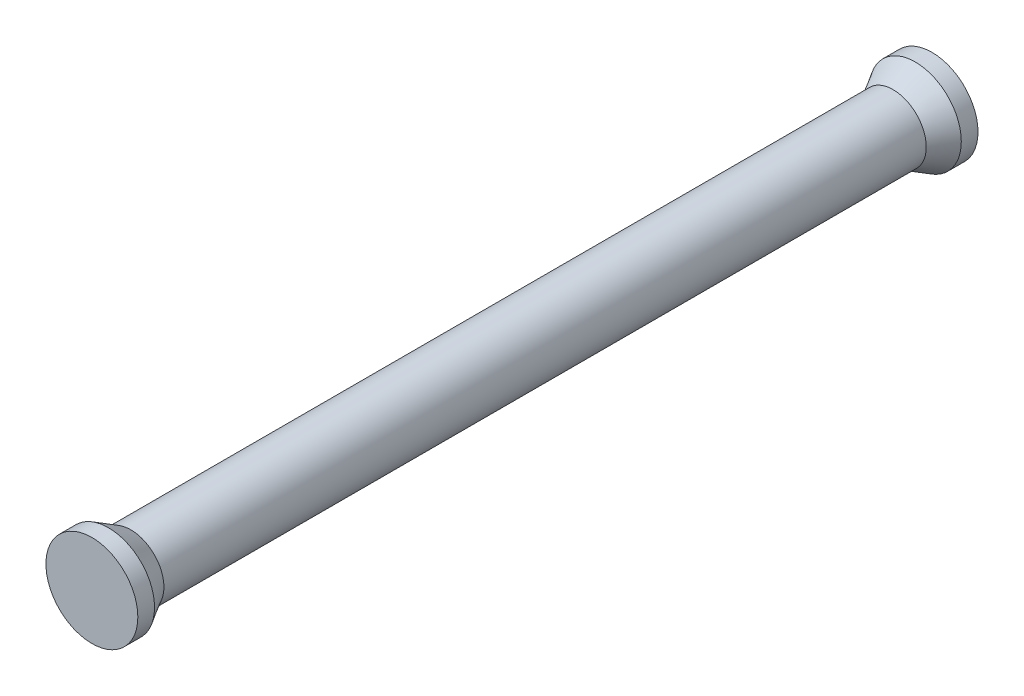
from build123d import *


with BuildPart() as part:
    # Sketch 1 → Revolve 1 (revolve)
    with BuildSketch(Plane(origin=(0, 0, 0), x_dir=(0, 0, -1), z_dir=(1, 0, 0)), mode=Mode.PRIVATE) as revolve_1_sk:
        Polygon((0, 0), (59.8932, 0), (59.8932, 3.2766), (58.702575, 3.2766), (57.118787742, 2.3622), (2.774412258, 2.3622), (1.190625, 3.2766), (0, 3.2766), align=None)
    revolve(revolve_1_sk.sketch.rotate(Axis((0, 0, 0), (0, 0, -1)), 90), axis=Axis((0, 0, 0), (0, 0, -1)))


solid = part.part
